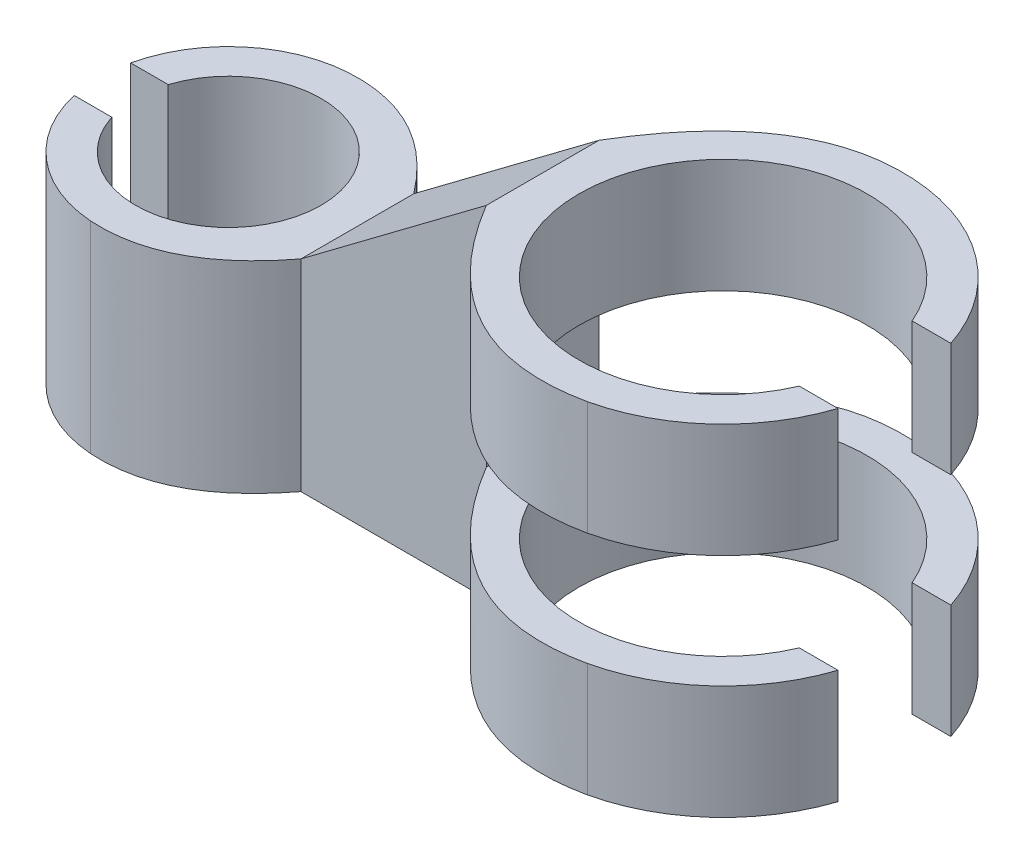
from build123d import *

# Parameters (mm, degrees)
SKETCH1_R           = 4.6
SKETCH1_W           = 9.2
SKETCH1_H           = 5.6
BOSS_EXTRUDE1_DEPTH = 10
SKETCH2_R           = 7.15
BOSS_EXTRUDE2_DEPTH = 16.9
BOSS_EXTRUDE3_DEPTH = 5.6
CUT_EXTRUDE1_START  = -11.25
SKETCH4_R           = 7.15
CUT_EXTRUDE1_DEPTH  = 5.6
SKETCH5_W           = 4.958248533
SKETCH5_H           = 2.8
CUT_EXTRUDE3_DEPTH  = 18.6
SKETCH6_W           = 7.123014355
SKETCH6_H           = 5.6
CUT_EXTRUDE4_DEPTH  = 18.6


with BuildPart() as part:
    # Sketch1 → Boss-Extrude1 (new body)
    # profile 1 of 4: a face of its own
    with BuildSketch(Plane(origin=(0, 0, 0), x_dir=(1, 0, 0), z_dir=(0, 1, 0))):
        with BuildLine():
            ThreePointArc((-4.096096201, -8.737979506), (0.429387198, -6.863462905), (2.303903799, -2.337979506))
            ThreePointArc((2.303903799, -2.337979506), (0.429387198, 2.187503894), (-4.096096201, 4.062020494))
            add(Edge.make_bspline(
                [(-4.096096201, 4.062020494), (-4.315413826, 4.060973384), (-4.537940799, 4.046750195)],
                knots=[0.943211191, 0.943211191, 0.943211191, 1, 1, 1], degree=2))
            ThreePointArc((-4.537940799, 4.046750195), (-10.496096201, -2.337979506), (-4.537940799, -8.722709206))
            add(Edge.make_bspline(
                [(-4.096096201, -8.737979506), (-4.315413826, -8.736932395), (-4.537940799, -8.722709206)],
                knots=[0.943211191, 0.943211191, 0.943211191, 1, 1, 1], degree=2))
        make_face()
        with Locations(Location((-4.096096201, -2.337979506, 0), (0, 0, 270))):
            Circle(SKETCH1_R, mode=Mode.SUBTRACT)
    # profile 2 of 4: a face of its own
    with BuildSketch(Plane(origin=(0, 0, 0), x_dir=(1, 0, 0), z_dir=(0, 1, 0))):
        with BuildLine():
            Line((2.303903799, -5.137979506), (2.303903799, -2.337979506))
            ThreePointArc((2.303903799, -2.337979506), (0.429387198, -6.863462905), (-4.096096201, -8.737979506))
            add(Edge.make_bspline(
                [(2.303903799, -5.137979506), (-0.453427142, -8.755371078), (-4.096096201, -8.737979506)],
                knots=[0, 0, 0, 0.943211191, 0.943211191, 0.943211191], degree=2))
        make_face()
    # profile 3 of 4: a face of its own
    with BuildSketch(Plane(origin=(0, 0, 0), x_dir=(1, 0, 0), z_dir=(0, 1, 0))):
        with BuildLine():
            Line((2.303903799, -2.337979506), (2.303903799, 0.462020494))
            add(Edge.make_bspline(
                [(2.303903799, 0.462020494), (-0.453427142, 4.079412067), (-4.096096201, 4.062020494)],
                knots=[0, 0, 0, 0.943211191, 0.943211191, 0.943211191], degree=2))
            ThreePointArc((-4.096096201, 4.062020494), (0.429387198, 2.187503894), (2.303903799, -2.337979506))
        make_face()
    # profile 4 of 4: a face of its own
    with BuildSketch(Plane(origin=(0, 0, 0), x_dir=(1, 0, 0), z_dir=(0, 1, 0))):
        with Locations((6.903903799, -2.337979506)):
            Rectangle(SKETCH1_W, SKETCH1_H)
    extrude(amount=BOSS_EXTRUDE1_DEPTH)

    # Sketch2 → Boss-Extrude2 (add)
    with BuildSketch(Plane.XZ):
        with BuildLine():
            add(Edge.make_bspline(
                [(20.453903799, 11.287979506), (21.427175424, 11.281633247), (22.453782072, 11.061682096)],
                knots=[0.84364156, 0.84364156, 0.84364156, 1, 1, 1], degree=2))
            add(Edge.make_bspline(
                [(11.503903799, 5.137979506), (15.202557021, 11.32222113), (20.453903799, 11.287979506)],
                knots=[0, 0, 0, 0.84364156, 0.84364156, 0.84364156], degree=2))
            Line((11.503903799, 5.137979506), (11.503903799, -0.462020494))
            add(Edge.make_bspline(
                [(11.503903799, -0.462020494), (15.202557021, -6.646262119), (20.453903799, -6.612020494)],
                knots=[0, 0, 0, 0.84364156, 0.84364156, 0.84364156], degree=2))
            add(Edge.make_bspline(
                [(20.453903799, -6.612020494), (21.427175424, -6.605674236), (22.453782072, -6.385723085)],
                knots=[0.84364156, 0.84364156, 0.84364156, 1, 1, 1], degree=2))
            ThreePointArc((22.453782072, -6.385723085), (29.403903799, 2.337979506), (22.453782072, 11.061682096))
        make_face()
        with Locations(Location((20.453903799, 2.337979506, 0), (0, 0, 270))):
            Circle(SKETCH2_R, mode=Mode.SUBTRACT)
    extrude(amount=-BOSS_EXTRUDE2_DEPTH)

    # Sketch3 → Boss-Extrude3 (add)
    with BuildSketch(Plane(origin=(0, 0, -0.462020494), x_dir=(-1, 0, 0), z_dir=(0, 0, -1))):
        Polygon((-11.503903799, 10), (-11.503903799, 16.9), (-2.303903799, 10), align=None)
    extrude(amount=-BOSS_EXTRUDE3_DEPTH)

    # Sketch4 → Cut-Extrude1 (cut)
    with BuildSketch(Plane(origin=(0, 16.9, 0), x_dir=(1, 0, 0), z_dir=(0, 1, 0)).offset(CUT_EXTRUDE1_START)):
        with BuildLine():
            Line((11.503903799, 0.462020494), (11.503903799, -5.137979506))
            add(Edge.make_bspline(
                [(11.503903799, -5.137979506), (15.888056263, -12.46839318), (22.453782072, -11.061682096)],
                knots=[0, 0, 0, 1, 1, 1], degree=2))
            ThreePointArc((22.453782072, -11.061682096), (29.403903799, -2.337979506), (22.453782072, 6.385723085))
            add(Edge.make_bspline(
                [(22.453782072, 6.385723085), (15.888056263, 7.792434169), (11.503903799, 0.462020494)],
                knots=[0, 0, 0, 1, 1, 1], degree=2))
        make_face()
        with Locations(Location((20.453903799, -2.337979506, 0), (0, 0, 90))):
            Circle(SKETCH4_R, mode=Mode.SUBTRACT)
    extrude(amount=CUT_EXTRUDE1_DEPTH, mode=Mode.SUBTRACT)

    # Sketch5 → Cut-Extrude3 (cut)
    with BuildSketch(Plane(origin=(0, 16.9, 0), x_dir=(1, 0, 0), z_dir=(0, 1, 0))):
        with Locations((-9.605952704, -2.337979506)):
            Rectangle(SKETCH5_W, SKETCH5_H)
    extrude(amount=-CUT_EXTRUDE3_DEPTH, mode=Mode.SUBTRACT)

    # Sketch6 → Cut-Extrude4 (cut)
    with BuildSketch(Plane(origin=(0, 16.9, 0), x_dir=(1, 0, 0), z_dir=(0, 1, 0))):
        with Locations((28.574529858, -2.337979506)):
            Rectangle(SKETCH6_W, SKETCH6_H)
    extrude(amount=-CUT_EXTRUDE4_DEPTH, mode=Mode.SUBTRACT)


solid = part.part
